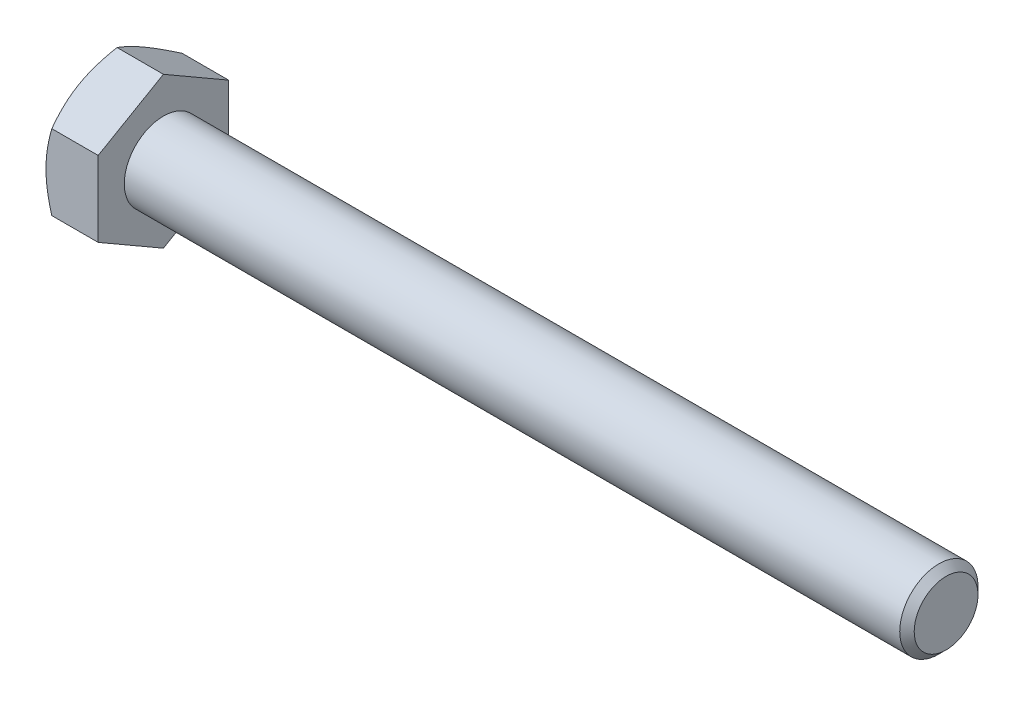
from build123d import *

# Parameters (mm, degrees)
BASEHEAD_DEPTH = 4


with BuildPart() as part:
    # Sketch1 → BaseHead (new body)
    with BuildSketch(Plane(origin=(0, 0, 0), x_dir=(0, 0, -1), z_dir=(1, 0, 0))):
        Polygon((5, 2.886751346), (5, -2.886751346), (0, -5.773502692), (-5, -2.886751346), (-5, 2.886751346), (0, 5.773502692), align=None)
    extrude(amount=BASEHEAD_DEPTH)

    # BodySke → BaseBody (revolve)
    with BuildSketch(Plane.XY, mode=Mode.PRIVATE) as basebody_sk:
        Polygon((0, 0), (64, 0), (64, 2.4455), (63.4455, 3), (0, 3), align=None)
    revolve(basebody_sk.sketch.rotate(Axis((0, 0, 0), (1, 0, 0)), 90), axis=Axis((0, 0, 0), (1, 0, 0)))

    # Sketch3 → HeadChamfer (revolve, cut)
    with BuildSketch(Plane.XY):
        Polygon((0, 5), (3.333333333, 10.773502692), (3.333333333, 15.773502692), (-10, 15.773502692), (-10, 5), align=None)
    revolve(axis=Axis((0, 0, 0), (1, 0, 0)), mode=Mode.SUBTRACT)


solid = part.part
